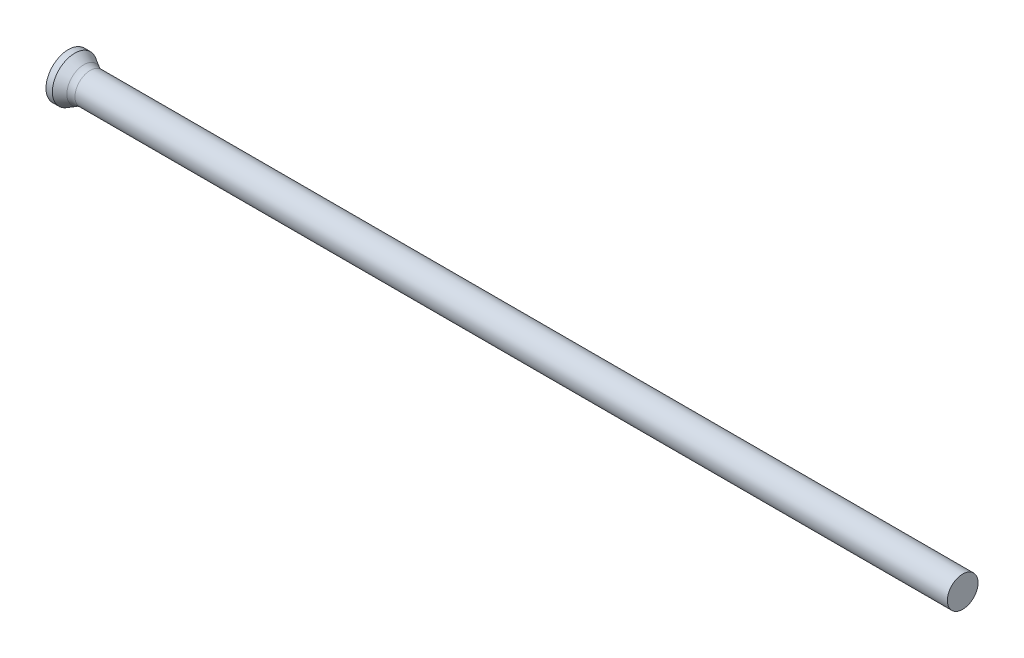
ISO-10303-21;
HEADER;
FILE_DESCRIPTION(('STEP AP214'),'2;1');
FILE_NAME('part.step','',(''),(''),'','','');
FILE_SCHEMA(('AUTOMOTIVE_DESIGN { 1 0 10303 214 1 1 1 1 }'));
ENDSEC;
DATA;
#1=APPLICATION_CONTEXT('core data for automotive mechanical design processes');
#2=APPLICATION_PROTOCOL_DEFINITION('international standard','automotive_design',2000,#1);
#3=PRODUCT_CONTEXT('',#1,'mechanical');
#4=PRODUCT('Part','Part','',(#3));
#5=PRODUCT_RELATED_PRODUCT_CATEGORY('part','',(#4));
#6=PRODUCT_DEFINITION_FORMATION('','',#4);
#7=PRODUCT_DEFINITION_CONTEXT('part definition',#1,'design');
#8=PRODUCT_DEFINITION('design','',#6,#7);
#9=PRODUCT_DEFINITION_SHAPE('','',#8);
#10=(LENGTH_UNIT() NAMED_UNIT(*) SI_UNIT(.MILLI.,.METRE.));
#11=(NAMED_UNIT(*) PLANE_ANGLE_UNIT() SI_UNIT($,.RADIAN.));
#12=(NAMED_UNIT(*) SI_UNIT($,.STERADIAN.) SOLID_ANGLE_UNIT());
#13=UNCERTAINTY_MEASURE_WITH_UNIT(LENGTH_MEASURE(1.E-05),#10,'distance_accuracy_value','');
#14=(GEOMETRIC_REPRESENTATION_CONTEXT(3) GLOBAL_UNCERTAINTY_ASSIGNED_CONTEXT((#13)) GLOBAL_UNIT_ASSIGNED_CONTEXT((#10,
#11,#12)) REPRESENTATION_CONTEXT('',''));
#15=CARTESIAN_POINT('',(0.,0.,0.));
#16=DIRECTION('',(0.,0.,1.));
#17=DIRECTION('',(1.,0.,0.));
#18=AXIS2_PLACEMENT_3D('',#15,#16,#17);
#19=CARTESIAN_POINT('',(0.,0.,0.));
#20=DIRECTION('',(1.,0.,0.));
#21=DIRECTION('',(0.,0.,-1.));
#22=AXIS2_PLACEMENT_3D('',#19,#20,#21);
#23=PLANE('',#22);
#24=CARTESIAN_POINT('',(0.,0.,0.));
#25=DIRECTION('',(-1.,0.,0.));
#26=DIRECTION('',(0.,0.,1.));
#27=AXIS2_PLACEMENT_3D('',#24,#25,#26);
#28=CIRCLE('',#27,1.75);
#29=CARTESIAN_POINT('',(0.,0.,1.75));
#30=VERTEX_POINT('',#29);
#31=EDGE_CURVE('E25',#30,#30,#28,.T.);
#32=ORIENTED_EDGE('',*,*,#31,.T.);
#33=EDGE_LOOP('',(#32));
#34=FACE_BOUND('',#33,.T.);
#35=ADVANCED_FACE('F14',(#34),#23,.F.);
#36=CARTESIAN_POINT('',(0.,0.,0.));
#37=DIRECTION('',(-1.,0.,0.));
#38=DIRECTION('',(0.,0.,1.));
#39=AXIS2_PLACEMENT_3D('',#36,#37,#38);
#40=CYLINDRICAL_SURFACE('',#39,1.75);
#41=ORIENTED_EDGE('',*,*,#31,.F.);
#42=EDGE_LOOP('',(#41));
#43=FACE_BOUND('',#42,.T.);
#44=CARTESIAN_POINT('',(0.497372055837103,0.,0.));
#45=DIRECTION('',(-1.,0.,0.));
#46=DIRECTION('',(0.,0.,1.));
#47=AXIS2_PLACEMENT_3D('',#44,#45,#46);
#48=CIRCLE('',#47,1.75);
#49=CARTESIAN_POINT('',(0.497372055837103,0.,1.75));
#50=VERTEX_POINT('',#49);
#51=EDGE_CURVE('E29',#50,#50,#48,.T.);
#52=ORIENTED_EDGE('',*,*,#51,.T.);
#53=EDGE_LOOP('',(#52));
#54=FACE_BOUND('',#53,.T.);
#55=ADVANCED_FACE('F53',(#43,#54),#40,.T.);
#56=CARTESIAN_POINT('',(1.45,0.,0.));
#57=DIRECTION('',(-1.,0.,0.));
#58=DIRECTION('',(0.,0.,1.));
#59=AXIS2_PLACEMENT_3D('',#56,#57,#58);
#60=CONICAL_SURFACE('',#59,1.2,0.523598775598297);
#61=CARTESIAN_POINT('',(1.21794919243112,0.,0.));
#62=DIRECTION('',(-1.,0.,0.));
#63=DIRECTION('',(0.,0.,1.));
#64=AXIS2_PLACEMENT_3D('',#61,#62,#63);
#65=CIRCLE('',#64,1.33397459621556);
#66=CARTESIAN_POINT('',(1.21794919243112,0.,1.33397459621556));
#67=VERTEX_POINT('',#66);
#68=EDGE_CURVE('E21',#67,#67,#65,.T.);
#69=ORIENTED_EDGE('',*,*,#68,.T.);
#70=EDGE_LOOP('',(#69));
#71=FACE_BOUND('',#70,.T.);
#72=ORIENTED_EDGE('',*,*,#51,.F.);
#73=EDGE_LOOP('',(#72));
#74=FACE_BOUND('',#73,.T.);
#75=ADVANCED_FACE('F50',(#71,#74),#60,.T.);
#76=CARTESIAN_POINT('',(0.,0.,0.));
#77=DIRECTION('',(-1.,0.,0.));
#78=DIRECTION('',(0.,0.,1.));
#79=AXIS2_PLACEMENT_3D('',#76,#77,#78);
#80=CYLINDRICAL_SURFACE('',#79,1.2);
#81=CARTESIAN_POINT('',(1.71794919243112,0.,0.));
#82=DIRECTION('',(-1.,0.,0.));
#83=DIRECTION('',(0.,0.,1.));
#84=AXIS2_PLACEMENT_3D('',#81,#82,#83);
#85=CIRCLE('',#84,1.2);
#86=CARTESIAN_POINT('',(1.71794919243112,0.,1.2));
#87=VERTEX_POINT('',#86);
#88=EDGE_CURVE('E9',#87,#87,#85,.F.);
#89=ORIENTED_EDGE('',*,*,#88,.T.);
#90=EDGE_LOOP('',(#89));
#91=FACE_BOUND('',#90,.T.);
#92=CARTESIAN_POINT('',(70.,0.,0.));
#93=DIRECTION('',(-1.,0.,0.));
#94=DIRECTION('',(0.,0.,1.));
#95=AXIS2_PLACEMENT_3D('',#92,#93,#94);
#96=CIRCLE('',#95,1.2);
#97=CARTESIAN_POINT('',(70.,0.,1.2));
#98=VERTEX_POINT('',#97);
#99=EDGE_CURVE('E34',#98,#98,#96,.T.);
#100=ORIENTED_EDGE('',*,*,#99,.T.);
#101=EDGE_LOOP('',(#100));
#102=FACE_BOUND('',#101,.T.);
#103=ADVANCED_FACE('F38',(#91,#102),#80,.T.);
#104=CARTESIAN_POINT('',(70.,1.2,0.));
#105=DIRECTION('',(-1.,0.,0.));
#106=DIRECTION('',(0.,0.,1.));
#107=AXIS2_PLACEMENT_3D('',#104,#105,#106);
#108=PLANE('',#107);
#109=ORIENTED_EDGE('',*,*,#99,.F.);
#110=EDGE_LOOP('',(#109));
#111=FACE_BOUND('',#110,.T.);
#112=ADVANCED_FACE('F40',(#111),#108,.F.);
#113=CARTESIAN_POINT('',(1.71794919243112,0.,0.));
#114=DIRECTION('',(-1.,0.,0.));
#115=DIRECTION('',(0.,0.,1.));
#116=AXIS2_PLACEMENT_3D('',#113,#114,#115);
#117=TOROIDAL_SURFACE('',#116,2.2,1.);
#118=ORIENTED_EDGE('',*,*,#88,.F.);
#119=EDGE_LOOP('',(#118));
#120=FACE_BOUND('',#119,.T.);
#121=ORIENTED_EDGE('',*,*,#68,.F.);
#122=EDGE_LOOP('',(#121));
#123=FACE_BOUND('',#122,.T.);
#124=ADVANCED_FACE('F16',(#120,#123),#117,.F.);
#125=CLOSED_SHELL('',(#35,#55,#75,#103,#112,#124));
#126=MANIFOLD_SOLID_BREP('B1',#125);
#127=ADVANCED_BREP_SHAPE_REPRESENTATION('',(#18,#126),#14);
#128=SHAPE_DEFINITION_REPRESENTATION(#9,#127);
ENDSEC;
END-ISO-10303-21;
